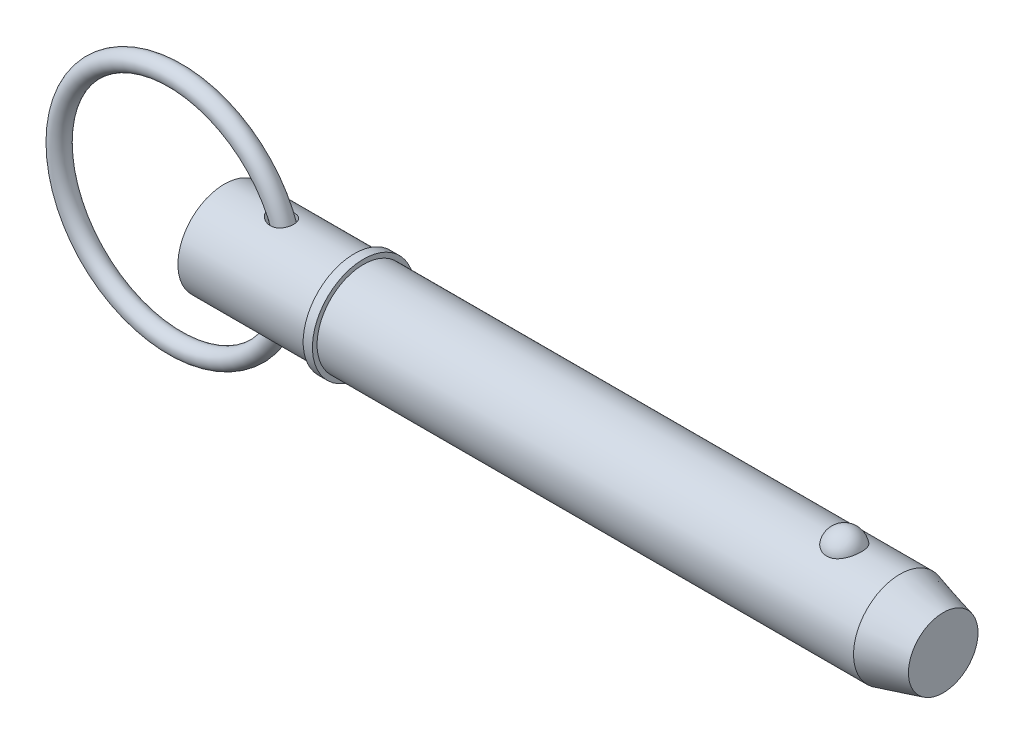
ISO-10303-21;
HEADER;
FILE_DESCRIPTION(('STEP AP214'),'2;1');
FILE_NAME('part.step','',(''),(''),'','','');
FILE_SCHEMA(('AUTOMOTIVE_DESIGN { 1 0 10303 214 1 1 1 1 }'));
ENDSEC;
DATA;
#1=APPLICATION_CONTEXT('core data for automotive mechanical design processes');
#2=APPLICATION_PROTOCOL_DEFINITION('international standard','automotive_design',2000,#1);
#3=PRODUCT_CONTEXT('',#1,'mechanical');
#4=PRODUCT('Part','Part','',(#3));
#5=PRODUCT_RELATED_PRODUCT_CATEGORY('part','',(#4));
#6=PRODUCT_DEFINITION_FORMATION('','',#4);
#7=PRODUCT_DEFINITION_CONTEXT('part definition',#1,'design');
#8=PRODUCT_DEFINITION('design','',#6,#7);
#9=PRODUCT_DEFINITION_SHAPE('','',#8);
#10=(LENGTH_UNIT() NAMED_UNIT(*) SI_UNIT(.MILLI.,.METRE.));
#11=(NAMED_UNIT(*) PLANE_ANGLE_UNIT() SI_UNIT($,.RADIAN.));
#12=(NAMED_UNIT(*) SI_UNIT($,.STERADIAN.) SOLID_ANGLE_UNIT());
#13=UNCERTAINTY_MEASURE_WITH_UNIT(LENGTH_MEASURE(1.E-05),#10,'distance_accuracy_value','');
#14=(GEOMETRIC_REPRESENTATION_CONTEXT(3) GLOBAL_UNCERTAINTY_ASSIGNED_CONTEXT((#13)) GLOBAL_UNIT_ASSIGNED_CONTEXT((#10,
#11,#12)) REPRESENTATION_CONTEXT('',''));
#15=CARTESIAN_POINT('',(0.,0.,0.));
#16=DIRECTION('',(0.,0.,1.));
#17=DIRECTION('',(1.,0.,0.));
#18=AXIS2_PLACEMENT_3D('',#15,#16,#17);
#19=CARTESIAN_POINT('',(-13.4840686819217,0.,0.));
#20=DIRECTION('',(0.,0.,1.));
#21=DIRECTION('',(1.,0.,0.));
#22=AXIS2_PLACEMENT_3D('',#19,#20,#21);
#23=TOROIDAL_SURFACE('',#22,31.75,2.54);
#24=CARTESIAN_POINT('',(20.8059313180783,0.,0.));
#25=VERTEX_POINT('',#24);
#26=VERTEX_LOOP('',#25);
#27=FACE_BOUND('',#26,.T.);
#28=ADVANCED_FACE('P0_F12',(#27),#23,.T.);
#29=CLOSED_SHELL('',(#28));
#30=MANIFOLD_SOLID_BREP('P0_B1',#29);
#31=CARTESIAN_POINT('',(0.,0.,0.));
#32=DIRECTION('',(1.,0.,0.));
#33=DIRECTION('',(0.,0.,-1.));
#34=AXIS2_PLACEMENT_3D('',#31,#32,#33);
#35=CYLINDRICAL_SURFACE('',#34,12.7);
#36=CARTESIAN_POINT('',(13.092900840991,12.5230976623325,-2.11234992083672));
#37=CARTESIAN_POINT('',(13.2535855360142,12.4976398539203,-2.26328363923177));
#38=CARTESIAN_POINT('',(13.4280602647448,12.4718592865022,-2.39955782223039));
#39=CARTESIAN_POINT('',(13.7976341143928,12.4229301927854,-2.64122157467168));
#40=CARTESIAN_POINT('',(13.9927568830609,12.3997847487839,-2.7465751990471));
#41=CARTESIAN_POINT('',(14.397672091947,12.3590534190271,-2.92439761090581));
#42=CARTESIAN_POINT('',(14.6074445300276,12.3414601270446,-2.99691026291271));
#43=CARTESIAN_POINT('',(15.0366557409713,12.3142893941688,-3.10669649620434));
#44=CARTESIAN_POINT('',(15.2560902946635,12.3047084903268,-3.14398530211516));
#45=CARTESIAN_POINT('',(15.5877843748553,12.2976819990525,-3.17128282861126));
#46=CARTESIAN_POINT('',(15.6989364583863,12.2965677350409,-3.17559470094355));
#47=CARTESIAN_POINT('',(15.9211629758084,12.2969101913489,-3.17427486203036));
#48=CARTESIAN_POINT('',(16.0322374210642,12.2983656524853,-3.16864802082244));
#49=CARTESIAN_POINT('',(16.2532861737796,12.3038832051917,-3.14715368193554));
#50=CARTESIAN_POINT('',(16.363260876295,12.3079443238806,-3.13129000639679));
#51=CARTESIAN_POINT('',(16.5810669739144,12.3185954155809,-3.08912320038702));
#52=CARTESIAN_POINT('',(16.6888986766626,12.3251850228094,-3.06282157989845));
#53=CARTESIAN_POINT('',(16.8894247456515,12.3398294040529,-3.00323791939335));
#54=CARTESIAN_POINT('',(16.9824664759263,12.3476389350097,-2.97106098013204));
#55=CARTESIAN_POINT('',(17.1651267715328,12.3648759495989,-2.89848824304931));
#56=CARTESIAN_POINT('',(17.2547457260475,12.3743032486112,-2.85809338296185));
#57=CARTESIAN_POINT('',(17.4297224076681,12.3944822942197,-2.76927391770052));
#58=CARTESIAN_POINT('',(17.5150817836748,12.40523352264,-2.72085245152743));
#59=CARTESIAN_POINT('',(17.6807665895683,12.4277046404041,-2.61629867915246));
#60=CARTESIAN_POINT('',(17.7610923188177,12.4394244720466,-2.56016683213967));
#61=CARTESIAN_POINT('',(17.9797287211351,12.4733252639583,-2.39133767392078));
#62=CARTESIAN_POINT('',(18.1114611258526,12.4961902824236,-2.27005507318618));
#63=CARTESIAN_POINT('',(18.3518677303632,12.5412050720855,-2.00648954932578));
#64=CARTESIAN_POINT('',(18.4605454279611,12.5633549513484,-1.86420981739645));
#65=CARTESIAN_POINT('',(18.6498843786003,12.6039384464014,-1.5661481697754));
#66=CARTESIAN_POINT('',(18.7311185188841,12.622444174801,-1.41073996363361));
#67=CARTESIAN_POINT('',(18.8669149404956,12.6543302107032,-1.08819514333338));
#68=CARTESIAN_POINT('',(18.921477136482,12.6677105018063,-0.921058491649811));
#69=CARTESIAN_POINT('',(19.0028875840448,12.6879542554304,-0.57902988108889));
#70=CARTESIAN_POINT('',(19.0296164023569,12.6947896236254,-0.40410783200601));
#71=CARTESIAN_POINT('',(19.0543673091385,12.7011128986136,-0.0521104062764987));
#72=CARTESIAN_POINT('',(19.0523885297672,12.7006005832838,0.124965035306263));
#73=CARTESIAN_POINT('',(19.019700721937,12.692266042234,0.476969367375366));
#74=CARTESIAN_POINT('',(18.9888798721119,12.6844153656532,0.651887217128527));
#75=CARTESIAN_POINT('',(18.8990221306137,12.6622099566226,0.99389064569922));
#76=CARTESIAN_POINT('',(18.839985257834,12.6478552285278,1.16097622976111));
#77=CARTESIAN_POINT('',(18.6951419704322,12.6142309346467,1.48231767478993));
#78=CARTESIAN_POINT('',(18.6093706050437,12.5949678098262,1.63659000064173));
#79=CARTESIAN_POINT('',(18.4131352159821,12.5536490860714,1.92810749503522));
#80=CARTESIAN_POINT('',(18.3026732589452,12.5315937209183,2.06535408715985));
#81=CARTESIAN_POINT('',(18.060669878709,12.4872833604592,2.31822774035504));
#82=CARTESIAN_POINT('',(17.9292520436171,12.4650302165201,2.43397343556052));
#83=CARTESIAN_POINT('',(17.6485957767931,12.4226514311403,2.64178289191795));
#84=CARTESIAN_POINT('',(17.4993587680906,12.4025256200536,2.73384854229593));
#85=CARTESIAN_POINT('',(17.1869531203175,12.3664726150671,2.8925825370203));
#86=CARTESIAN_POINT('',(17.0237450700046,12.3505578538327,2.95917592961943));
#87=CARTESIAN_POINT('',(16.6884731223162,12.3245177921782,3.06582547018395));
#88=CARTESIAN_POINT('',(16.516407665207,12.3143935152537,3.10587692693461));
#89=CARTESIAN_POINT('',(16.1604213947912,12.3003788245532,3.16093927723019));
#90=CARTESIAN_POINT('',(15.9763106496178,12.2967791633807,3.17478342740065));
#91=CARTESIAN_POINT('',(15.6080973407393,12.2966663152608,3.1752118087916));
#92=CARTESIAN_POINT('',(15.4239948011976,12.3001555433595,3.16178674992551));
#93=CARTESIAN_POINT('',(15.0417156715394,12.3141744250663,3.10676725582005));
#94=CARTESIAN_POINT('',(14.8439465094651,12.3253658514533,3.06251977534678));
#95=CARTESIAN_POINT('',(14.4574652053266,12.3538942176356,2.94531863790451));
#96=CARTESIAN_POINT('',(14.2687614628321,12.3712367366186,2.87233891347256));
#97=CARTESIAN_POINT('',(13.8856104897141,12.4121323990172,2.69045747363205));
#98=CARTESIAN_POINT('',(13.6926012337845,12.4361434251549,2.57861276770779));
#99=CARTESIAN_POINT('',(13.328588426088,12.4862632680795,2.32379935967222));
#100=CARTESIAN_POINT('',(13.1575718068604,12.5123708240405,2.18084927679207));
#101=CARTESIAN_POINT('',(12.8776146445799,12.5579467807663,1.89840233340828));
#102=CARTESIAN_POINT('',(12.7631663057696,12.5776642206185,1.76440341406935));
#103=CARTESIAN_POINT('',(12.5574911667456,12.6143643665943,1.47931295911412));
#104=CARTESIAN_POINT('',(12.4662309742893,12.6313509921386,1.32824646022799));
#105=CARTESIAN_POINT('',(12.3240650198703,12.6583901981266,1.03598403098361));
#106=CARTESIAN_POINT('',(12.2691183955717,12.6691064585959,0.89682285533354));
#107=CARTESIAN_POINT('',(12.1828741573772,12.6860954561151,0.611068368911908));
#108=CARTESIAN_POINT('',(12.1515620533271,12.6923709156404,0.464479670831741));
#109=CARTESIAN_POINT('',(12.1147168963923,12.6997676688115,0.167420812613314));
#110=CARTESIAN_POINT('',(12.109270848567,12.7008715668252,0.0169392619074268));
#111=CARTESIAN_POINT('',(12.1248234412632,12.6977391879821,-0.282592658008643));
#112=CARTESIAN_POINT('',(12.1458245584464,12.6935024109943,-0.431642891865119));
#113=CARTESIAN_POINT('',(12.210908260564,12.6805581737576,-0.716008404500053));
#114=CARTESIAN_POINT('',(12.2537133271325,12.6720986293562,-0.851633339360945));
#115=CARTESIAN_POINT('',(12.3591295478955,12.6516826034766,-1.11460776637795));
#116=CARTESIAN_POINT('',(12.4217455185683,12.6397252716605,-1.24195523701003));
#117=CARTESIAN_POINT('',(12.5735635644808,12.61152213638,-1.50300095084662));
#118=CARTESIAN_POINT('',(12.6652159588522,12.5949150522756,-1.63522875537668));
#119=CARTESIAN_POINT('',(12.8664347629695,12.5599626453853,-1.88501670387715));
#120=CARTESIAN_POINT('',(12.9760196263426,12.541615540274,-2.00256151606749));
#121=CARTESIAN_POINT('',(13.092900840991,12.5230976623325,-2.11234992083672));
#122=B_SPLINE_CURVE_WITH_KNOTS('',3,(#36,#37,#38,#39,#40,#41,#42,#43,#44,#45,#46,#47,#48,#49,
#50,#51,#52,#53,#54,#55,#56,#57,#58,#59,#60,#61,#62,#63,#64,#65,#66,#67,#68,#69,#70,#71,#72,#73,
#74,#75,#76,#77,#78,#79,#80,#81,#82,#83,#84,#85,#86,#87,#88,#89,#90,#91,#92,#93,#94,#95,#96,#97,
#98,#99,#100,#101,#102,#103,#104,#105,#106,#107,#108,#109,#110,#111,#112,#113,#114,#115,#116,
#117,#118,#119,#120,#121),.UNSPECIFIED.,.T.,.F.,(4,2,2,2,2,2,2,2,2,2,2,2,2,2,2,2,2,2,2,2,2,2,2,
2,2,2,2,2,2,2,2,2,2,2,2,2,2,2,2,2,2,2,4),(0.,0.665132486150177,1.33103515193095,
1.99604575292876,2.66076878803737,2.99410229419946,3.32727250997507,3.66031840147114,
3.99331613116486,4.28918991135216,4.58502994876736,4.88075456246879,5.17646157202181,
5.71510826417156,6.25367317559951,6.78017774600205,7.30668400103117,7.83544030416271,
8.36421259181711,8.89504347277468,9.42587399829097,9.95601150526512,10.4861046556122,
11.0131799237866,11.54021312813,12.0687854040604,12.597451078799,13.1491450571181,
13.7010270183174,14.3074556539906,14.914435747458,15.5844380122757,16.2540403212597,
16.7839879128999,17.3131679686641,17.7612578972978,18.2090728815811,18.658393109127,
19.1077554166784,19.5333866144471,19.959121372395,20.4424347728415,20.9262486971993),.UNSPECIFIED.);
#123=CARTESIAN_POINT('',(13.092900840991,12.5230976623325,-2.11234992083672));
#124=VERTEX_POINT('',#123);
#125=EDGE_CURVE('P1_E42',#124,#124,#122,.T.);
#126=ORIENTED_EDGE('',*,*,#125,.T.);
#127=EDGE_LOOP('',(#126));
#128=FACE_BOUND('',#127,.T.);
#129=CARTESIAN_POINT('',(0.,0.,0.));
#130=DIRECTION('',(1.,0.,0.));
#131=DIRECTION('',(0.,0.,-1.));
#132=AXIS2_PLACEMENT_3D('',#129,#130,#131);
#133=CIRCLE('',#132,12.7);
#134=CARTESIAN_POINT('',(0.,0.,-12.7));
#135=VERTEX_POINT('',#134);
#136=EDGE_CURVE('P1_E9',#135,#135,#133,.T.);
#137=ORIENTED_EDGE('',*,*,#136,.T.);
#138=EDGE_LOOP('',(#137));
#139=FACE_BOUND('',#138,.T.);
#140=CARTESIAN_POINT('',(35.56,0.,0.));
#141=DIRECTION('',(1.,0.,0.));
#142=DIRECTION('',(0.,0.,-1.));
#143=AXIS2_PLACEMENT_3D('',#140,#141,#142);
#144=CIRCLE('',#143,12.7);
#145=CARTESIAN_POINT('',(35.56,0.,-12.7));
#146=VERTEX_POINT('',#145);
#147=EDGE_CURVE('P1_E25',#146,#146,#144,.T.);
#148=ORIENTED_EDGE('',*,*,#147,.F.);
#149=EDGE_LOOP('',(#148));
#150=FACE_BOUND('',#149,.T.);
#151=CARTESIAN_POINT('',(13.092900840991,-12.5230976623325,-2.11234992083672));
#152=CARTESIAN_POINT('',(12.9659872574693,-12.5432050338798,-1.99314161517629));
#153=CARTESIAN_POINT('',(12.847667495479,-12.5631124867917,-1.86478966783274));
#154=CARTESIAN_POINT('',(12.6324721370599,-12.6007427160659,-1.59069749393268));
#155=CARTESIAN_POINT('',(12.5355833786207,-12.6184668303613,-1.444968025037));
#156=CARTESIAN_POINT('',(12.4099071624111,-12.642034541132,-1.21450950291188));
#157=CARTESIAN_POINT('',(12.3711427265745,-12.6494175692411,-1.13527163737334));
#158=CARTESIAN_POINT('',(12.3010994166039,-12.6628962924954,-0.973464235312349));
#159=CARTESIAN_POINT('',(12.2698164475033,-12.6689926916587,-0.890896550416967));
#160=CARTESIAN_POINT('',(12.2153933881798,-12.6796767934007,-0.72309085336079));
#161=CARTESIAN_POINT('',(12.192246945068,-12.6842656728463,-0.637854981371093));
#162=CARTESIAN_POINT('',(12.154603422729,-12.6917620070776,-0.465421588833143));
#163=CARTESIAN_POINT('',(12.1401047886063,-12.69466976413,-0.378224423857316));
#164=CARTESIAN_POINT('',(12.1214471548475,-12.6984180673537,-0.214417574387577));
#165=CARTESIAN_POINT('',(12.1161713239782,-12.699481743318,-0.13793855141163));
#166=CARTESIAN_POINT('',(12.1124989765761,-12.7002217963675,0.0152189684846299));
#167=CARTESIAN_POINT('',(12.1141046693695,-12.6998977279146,0.0918975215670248));
#168=CARTESIAN_POINT('',(12.1241695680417,-12.6978712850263,0.244746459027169));
#169=CARTESIAN_POINT('',(12.132625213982,-12.6961696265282,0.320917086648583));
#170=CARTESIAN_POINT('',(12.1562110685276,-12.6914452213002,0.472185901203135));
#171=CARTESIAN_POINT('',(12.1713438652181,-12.6884219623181,0.547283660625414));
#172=CARTESIAN_POINT('',(12.223731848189,-12.6780227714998,0.759415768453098));
#173=CARTESIAN_POINT('',(12.268839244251,-12.6691353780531,0.894507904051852));
#174=CARTESIAN_POINT('',(12.3786059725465,-12.6479567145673,1.1560647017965));
#175=CARTESIAN_POINT('',(12.4432700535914,-12.6356646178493,1.28252725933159));
#176=CARTESIAN_POINT('',(12.5971341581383,-12.607236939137,1.5381272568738));
#177=CARTESIAN_POINT('',(12.6882234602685,-12.5908303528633,1.66609325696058));
#178=CARTESIAN_POINT('',(12.887209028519,-12.5564642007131,1.90792082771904));
#179=CARTESIAN_POINT('',(12.995115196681,-12.5385037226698,2.02177401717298));
#180=CARTESIAN_POINT('',(13.2471335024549,-12.4987806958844,2.25547266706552));
#181=CARTESIAN_POINT('',(13.3941979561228,-12.4769622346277,2.3721269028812));
#182=CARTESIAN_POINT('',(13.7036983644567,-12.4349587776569,2.58329351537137));
#183=CARTESIAN_POINT('',(13.8661464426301,-12.4147750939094,2.67778822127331));
#184=CARTESIAN_POINT('',(14.2306024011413,-12.3748157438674,2.85722657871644));
#185=CARTESIAN_POINT('',(14.4347220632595,-12.3556533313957,2.93804226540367));
#186=CARTESIAN_POINT('',(14.8540416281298,-12.3245430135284,3.06594877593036));
#187=CARTESIAN_POINT('',(15.0692453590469,-12.3125976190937,3.11302786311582));
#188=CARTESIAN_POINT('',(15.3981213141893,-12.3014943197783,3.15648626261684));
#189=CARTESIAN_POINT('',(15.5100235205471,-12.298940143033,3.16639841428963));
#190=CARTESIAN_POINT('',(15.7342812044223,-12.2963942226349,3.17627668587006));
#191=CARTESIAN_POINT('',(15.8466364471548,-12.2964012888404,3.17624742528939));
#192=CARTESIAN_POINT('',(16.0707903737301,-12.2990694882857,3.16589868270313));
#193=CARTESIAN_POINT('',(16.1825892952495,-12.3017293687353,3.1555840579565));
#194=CARTESIAN_POINT('',(16.4046123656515,-12.3096862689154,3.12440163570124));
#195=CARTESIAN_POINT('',(16.514836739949,-12.314982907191,3.10353536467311));
#196=CARTESIAN_POINT('',(16.7211934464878,-12.3273933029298,3.05384263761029));
#197=CARTESIAN_POINT('',(16.8175961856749,-12.3342598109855,3.0260738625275));
#198=CARTESIAN_POINT('',(17.0073515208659,-12.3498131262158,2.96195947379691));
#199=CARTESIAN_POINT('',(17.100704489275,-12.3584997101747,2.92561491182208));
#200=CARTESIAN_POINT('',(17.2834584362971,-12.3774243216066,2.84448580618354));
#201=CARTESIAN_POINT('',(17.3728610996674,-12.3876616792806,2.79970490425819));
#202=CARTESIAN_POINT('',(17.5469061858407,-12.409352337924,2.701939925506));
#203=CARTESIAN_POINT('',(17.6315489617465,-12.4208055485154,2.64895645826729));
#204=CARTESIAN_POINT('',(17.7872886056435,-12.4433734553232,2.54070972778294));
#205=CARTESIAN_POINT('',(17.8589017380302,-12.4544123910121,2.4861716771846));
#206=CARTESIAN_POINT('',(17.9970802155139,-12.4768404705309,2.37105291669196));
#207=CARTESIAN_POINT('',(18.063643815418,-12.4882297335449,2.31047013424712));
#208=CARTESIAN_POINT('',(18.1911677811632,-12.5110137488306,2.18372894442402));
#209=CARTESIAN_POINT('',(18.2521311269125,-12.5224084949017,2.11757353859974));
#210=CARTESIAN_POINT('',(18.3680676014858,-12.5448751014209,1.98014449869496));
#211=CARTESIAN_POINT('',(18.4230385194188,-12.5559468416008,1.90886899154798));
#212=CARTESIAN_POINT('',(18.5752306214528,-12.5875288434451,1.6925769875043));
#213=CARTESIAN_POINT('',(18.6637018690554,-12.6071482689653,1.54111740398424));
#214=CARTESIAN_POINT('',(18.8143485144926,-12.6417556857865,1.225260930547));
#215=CARTESIAN_POINT('',(18.876524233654,-12.6567437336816,1.06086419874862));
#216=CARTESIAN_POINT('',(18.9733884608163,-12.6805238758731,0.723195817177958));
#217=CARTESIAN_POINT('',(19.0079967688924,-12.6892978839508,0.549899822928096));
#218=CARTESIAN_POINT('',(19.0486500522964,-12.6996362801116,0.199781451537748));
#219=CARTESIAN_POINT('',(19.054694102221,-12.7012004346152,0.0229589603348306));
#220=CARTESIAN_POINT('',(19.0380549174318,-12.6969431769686,-0.330044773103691));
#221=CARTESIAN_POINT('',(19.0152419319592,-12.6910884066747,-0.506219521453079));
#222=CARTESIAN_POINT('',(18.9411599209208,-12.672565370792,-0.852112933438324));
#223=CARTESIAN_POINT('',(18.8898907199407,-12.659897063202,-1.0218315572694));
#224=CARTESIAN_POINT('',(18.7600888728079,-12.6291327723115,-1.34987035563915));
#225=CARTESIAN_POINT('',(18.6815715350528,-12.6110398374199,-1.50819687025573));
#226=CARTESIAN_POINT('',(18.4991526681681,-12.5714188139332,-1.808997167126));
#227=CARTESIAN_POINT('',(18.3952529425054,-12.5498909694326,-1.95147207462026));
#228=CARTESIAN_POINT('',(18.1653806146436,-12.5059234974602,-2.21580059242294));
#229=CARTESIAN_POINT('',(18.0395297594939,-12.4834893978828,-2.33776101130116));
#230=CARTESIAN_POINT('',(17.7688701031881,-12.4400863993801,-2.55870399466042));
#231=CARTESIAN_POINT('',(17.624063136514,-12.4191173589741,-2.65768878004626));
#232=CARTESIAN_POINT('',(17.3196803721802,-12.380896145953,-2.8304192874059));
#233=CARTESIAN_POINT('',(17.1601036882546,-12.3636441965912,-2.90416349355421));
#234=CARTESIAN_POINT('',(16.8308162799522,-12.3345597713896,-3.02531546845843));
#235=CARTESIAN_POINT('',(16.6611041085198,-12.322728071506,-3.07271946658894));
#236=CARTESIAN_POINT('',(16.3099674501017,-12.3051318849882,-3.14246490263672));
#237=CARTESIAN_POINT('',(16.1283412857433,-12.2996014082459,-3.16384159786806));
#238=CARTESIAN_POINT('',(15.7639014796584,-12.2955807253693,-3.17942379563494));
#239=CARTESIAN_POINT('',(15.5810875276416,-12.2970924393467,-3.17362188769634));
#240=CARTESIAN_POINT('',(15.20154276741,-12.307074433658,-3.13470416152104));
#241=CARTESIAN_POINT('',(15.0050835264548,-12.316173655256,-3.09911848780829));
#242=CARTESIAN_POINT('',(14.6197996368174,-12.3407987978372,-2.99954607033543));
#243=CARTESIAN_POINT('',(14.4309834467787,-12.3563316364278,-2.93552875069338));
#244=CARTESIAN_POINT('',(14.0353751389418,-12.3949378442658,-2.76840280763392));
#245=CARTESIAN_POINT('',(13.8306109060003,-12.4188242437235,-2.66064798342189));
#246=CARTESIAN_POINT('',(13.4432099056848,-12.4696241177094,-2.4113475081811));
#247=CARTESIAN_POINT('',(13.2605568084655,-12.4965353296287,-2.26982702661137));
#248=CARTESIAN_POINT('',(13.092900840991,-12.5230976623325,-2.11234992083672));
#249=B_SPLINE_CURVE_WITH_KNOTS('',3,(#151,#152,#153,#154,#155,#156,#157,#158,#159,#160,#161,
#162,#163,#164,#165,#166,#167,#168,#169,#170,#171,#172,#173,#174,#175,#176,#177,#178,#179,#180,
#181,#182,#183,#184,#185,#186,#187,#188,#189,#190,#191,#192,#193,#194,#195,#196,#197,#198,#199,
#200,#201,#202,#203,#204,#205,#206,#207,#208,#209,#210,#211,#212,#213,#214,#215,#216,#217,#218,
#219,#220,#221,#222,#223,#224,#225,#226,#227,#228,#229,#230,#231,#232,#233,#234,#235,#236,#237,
#238,#239,#240,#241,#242,#243,#244,#245,#246,#247,#248),.UNSPECIFIED.,.T.,.F.,(4,2,2,2,2,2,2,2,
2,2,2,2,2,2,2,2,2,2,2,2,2,2,2,2,2,2,2,2,2,2,2,2,2,2,2,2,2,2,2,2,2,2,2,2,2,2,2,2,4),(0.,
0.525289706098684,1.05025590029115,1.31549608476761,1.58059075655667,1.84547798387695,
2.11031756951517,2.34000998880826,2.56977615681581,2.79942299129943,3.0291589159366,
3.45531787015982,3.8815803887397,4.35362362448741,4.82594586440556,5.39074449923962,
5.95599200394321,6.61421946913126,7.27267581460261,7.60939383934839,7.94595540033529,
8.2823580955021,8.61871213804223,8.91997243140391,9.22119579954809,9.52228943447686,
9.82336070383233,10.0950952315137,10.3669232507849,10.6386057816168,10.9103882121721,
11.4371688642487,11.9639430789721,12.4922442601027,13.0205625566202,13.5512648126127,
14.0819703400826,14.6123781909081,15.1427483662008,15.6702654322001,16.1977314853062,
16.7252292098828,17.2528024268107,17.7993878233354,18.3461222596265,18.9432829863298,
19.5410874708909,20.2355241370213,20.9294447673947),.UNSPECIFIED.);
#250=CARTESIAN_POINT('',(13.092900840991,-12.5230976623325,-2.11234992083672));
#251=VERTEX_POINT('',#250);
#252=EDGE_CURVE('P1_E17',#251,#251,#249,.T.);
#253=ORIENTED_EDGE('',*,*,#252,.T.);
#254=EDGE_LOOP('',(#253));
#255=FACE_BOUND('',#254,.T.);
#256=ADVANCED_FACE('P1_F13',(#128,#139,#150,#255),#35,.T.);
#257=CARTESIAN_POINT('',(0.,0.,0.));
#258=DIRECTION('',(1.,0.,0.));
#259=DIRECTION('',(0.,0.,-1.));
#260=AXIS2_PLACEMENT_3D('',#257,#258,#259);
#261=CYLINDRICAL_SURFACE('',#260,12.7);
#262=CARTESIAN_POINT('',(185.000738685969,0.,0.));
#263=DIRECTION('',(1.,0.,0.));
#264=DIRECTION('',(0.,0.,-1.));
#265=AXIS2_PLACEMENT_3D('',#262,#263,#264);
#266=CIRCLE('',#265,12.7);
#267=CARTESIAN_POINT('',(185.000738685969,0.,-12.7));
#268=VERTEX_POINT('',#267);
#269=EDGE_CURVE('P1_E99',#268,#268,#266,.T.);
#270=ORIENTED_EDGE('',*,*,#269,.F.);
#271=EDGE_LOOP('',(#270));
#272=FACE_BOUND('',#271,.T.);
#273=CARTESIAN_POINT('',(38.1,0.,0.));
#274=DIRECTION('',(1.,0.,0.));
#275=DIRECTION('',(0.,0.,-1.));
#276=AXIS2_PLACEMENT_3D('',#273,#274,#275);
#277=CIRCLE('',#276,12.7);
#278=CARTESIAN_POINT('',(38.1,0.,-12.7));
#279=VERTEX_POINT('',#278);
#280=EDGE_CURVE('P1_E96',#279,#279,#277,.T.);
#281=ORIENTED_EDGE('',*,*,#280,.T.);
#282=EDGE_LOOP('',(#281));
#283=FACE_BOUND('',#282,.T.);
#284=CARTESIAN_POINT('',(169.760042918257,11.7500437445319,4.81938502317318));
#285=CARTESIAN_POINT('',(169.635088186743,11.7500430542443,4.81938571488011));
#286=CARTESIAN_POINT('',(169.510144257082,11.7520975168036,4.81438658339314));
#287=CARTESIAN_POINT('',(169.261142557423,11.760253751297,4.79442904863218));
#288=CARTESIAN_POINT('',(169.137085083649,11.7663568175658,4.77946746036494));
#289=CARTESIAN_POINT('',(168.890901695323,11.7824262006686,4.7397141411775));
#290=CARTESIAN_POINT('',(168.768774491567,11.7923898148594,4.71492928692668));
#291=CARTESIAN_POINT('',(168.527187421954,11.8158938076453,4.65571340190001));
#292=CARTESIAN_POINT('',(168.40772859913,11.8294355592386,4.6212786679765));
#293=CARTESIAN_POINT('',(168.172557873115,11.8596812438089,4.54309502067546));
#294=CARTESIAN_POINT('',(168.056839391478,11.8763792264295,4.49936361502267));
#295=CARTESIAN_POINT('',(167.829653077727,11.9124878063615,4.40287235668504));
#296=CARTESIAN_POINT('',(167.718186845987,11.9318994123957,4.35010914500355));
#297=CARTESIAN_POINT('',(167.391278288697,11.9934256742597,4.17881316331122));
#298=CARTESIAN_POINT('',(167.183127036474,12.038858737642,4.04720756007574));
#299=CARTESIAN_POINT('',(166.785850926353,12.1352173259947,3.748564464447));
#300=CARTESIAN_POINT('',(166.597443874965,12.1862630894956,3.58061821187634));
#301=CARTESIAN_POINT('',(166.250521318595,12.2875163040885,3.21600758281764));
#302=CARTESIAN_POINT('',(166.092011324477,12.3377235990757,3.01933792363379));
#303=CARTESIAN_POINT('',(165.80168878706,12.4344923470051,2.592916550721));
#304=CARTESIAN_POINT('',(165.671376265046,12.4807925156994,2.36208286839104));
#305=CARTESIAN_POINT('',(165.449407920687,12.5623454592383,1.88070399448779));
#306=CARTESIAN_POINT('',(165.357755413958,12.5975972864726,1.63015711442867));
#307=CARTESIAN_POINT('',(165.214046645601,12.6538414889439,1.1129886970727));
#308=CARTESIAN_POINT('',(165.162499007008,12.6746503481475,0.846205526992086));
#309=CARTESIAN_POINT('',(165.101977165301,12.699153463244,0.307085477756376));
#310=CARTESIAN_POINT('',(165.093001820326,12.7028481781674,0.0347487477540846));
#311=CARTESIAN_POINT('',(165.117731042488,12.6927785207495,-0.506073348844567));
#312=CARTESIAN_POINT('',(165.151189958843,12.6791146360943,-0.774571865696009));
#313=CARTESIAN_POINT('',(165.259687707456,12.635882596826,-1.30170246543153));
#314=CARTESIAN_POINT('',(165.33472729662,12.606314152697,-1.56033436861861));
#315=CARTESIAN_POINT('',(165.52500006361,12.5342328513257,-2.0608389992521));
#316=CARTESIAN_POINT('',(165.640287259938,12.4917026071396,-2.30268867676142));
#317=CARTESIAN_POINT('',(165.908704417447,12.3981123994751,-2.76259600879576));
#318=CARTESIAN_POINT('',(166.061837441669,12.3470517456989,-2.98065173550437));
#319=CARTESIAN_POINT('',(166.403507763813,12.2416045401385,-3.38786328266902));
#320=CARTESIAN_POINT('',(166.592201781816,12.1872040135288,-3.57688418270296));
#321=CARTESIAN_POINT('',(167.000239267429,12.0814086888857,-3.91941073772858));
#322=CARTESIAN_POINT('',(167.219580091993,12.0300136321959,-4.07291945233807));
#323=CARTESIAN_POINT('',(167.678375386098,11.9373542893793,-4.33691289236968));
#324=CARTESIAN_POINT('',(167.917304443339,11.8958982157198,-4.44824125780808));
#325=CARTESIAN_POINT('',(168.41243761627,11.8268116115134,-4.62881985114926));
#326=CARTESIAN_POINT('',(168.668635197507,11.7991758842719,-4.69808589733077));
#327=CARTESIAN_POINT('',(169.177164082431,11.7622209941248,-4.78983181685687));
#328=CARTESIAN_POINT('',(169.429041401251,11.7520502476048,-4.81449025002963));
#329=CARTESIAN_POINT('',(169.933573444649,11.7485796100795,-4.82295735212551));
#330=CARTESIAN_POINT('',(170.186228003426,11.7552763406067,-4.80677420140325));
#331=CARTESIAN_POINT('',(170.676834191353,11.7842584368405,-4.73525430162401));
#332=CARTESIAN_POINT('',(170.914998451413,11.8060486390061,-4.68116061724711));
#333=CARTESIAN_POINT('',(171.378489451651,11.8622750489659,-4.53678133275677));
#334=CARTESIAN_POINT('',(171.603815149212,11.8967122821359,-4.44649279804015));
#335=CARTESIAN_POINT('',(172.040801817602,11.9754603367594,-4.2298761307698));
#336=CARTESIAN_POINT('',(172.252057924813,12.0199699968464,-4.10280539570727));
#337=CARTESIAN_POINT('',(172.650601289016,12.1138028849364,-3.81685409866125));
#338=CARTESIAN_POINT('',(172.837883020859,12.163127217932,-3.65796622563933));
#339=CARTESIAN_POINT('',(173.193350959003,12.2642343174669,-3.30364864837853));
#340=CARTESIAN_POINT('',(173.360111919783,12.3160165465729,-3.10678783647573));
#341=CARTESIAN_POINT('',(173.659579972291,12.4142566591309,-2.68748409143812));
#342=CARTESIAN_POINT('',(173.792280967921,12.4607135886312,-2.4650365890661));
#343=CARTESIAN_POINT('',(174.024691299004,12.5450236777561,-1.9928951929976));
#344=CARTESIAN_POINT('',(174.123215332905,12.5825557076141,-1.74255918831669));
#345=CARTESIAN_POINT('',(174.279227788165,12.6431720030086,-1.2277373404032));
#346=CARTESIAN_POINT('',(174.336715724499,12.6662560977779,-0.96325132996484));
#347=CARTESIAN_POINT('',(174.409544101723,12.6956486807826,-0.427355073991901));
#348=CARTESIAN_POINT('',(174.424837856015,12.7019385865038,-0.155937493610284));
#349=CARTESIAN_POINT('',(174.412779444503,12.6970201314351,0.385928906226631));
#350=CARTESIAN_POINT('',(174.38542805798,12.6858120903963,0.65637774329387));
#351=CARTESIAN_POINT('',(174.313060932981,12.6568455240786,1.05454017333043));
#352=CARTESIAN_POINT('',(174.283796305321,12.6451962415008,1.185778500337));
#353=CARTESIAN_POINT('',(174.215022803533,12.6181819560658,1.44513808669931));
#354=CARTESIAN_POINT('',(174.175517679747,12.6028183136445,1.57326046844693));
#355=CARTESIAN_POINT('',(174.086439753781,12.5687547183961,1.82554978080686));
#356=CARTESIAN_POINT('',(174.036862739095,12.5500533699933,1.9497150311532));
#357=CARTESIAN_POINT('',(173.92792115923,12.5098093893,2.1931437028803));
#358=CARTESIAN_POINT('',(173.868560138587,12.4882677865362,2.31240887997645));
#359=CARTESIAN_POINT('',(173.73997128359,12.4427679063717,2.5459303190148));
#360=CARTESIAN_POINT('',(173.670688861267,12.4187964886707,2.66015396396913));
#361=CARTESIAN_POINT('',(173.522903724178,12.3691892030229,2.88202659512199));
#362=CARTESIAN_POINT('',(173.444404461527,12.3435539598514,2.98967802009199));
#363=CARTESIAN_POINT('',(173.27855022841,12.2912955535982,3.1977438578));
#364=CARTESIAN_POINT('',(173.191191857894,12.2646720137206,3.29815546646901));
#365=CARTESIAN_POINT('',(173.008161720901,12.2111945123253,3.49095035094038));
#366=CARTESIAN_POINT('',(172.912493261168,12.1843406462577,3.58333679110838));
#367=CARTESIAN_POINT('',(172.713627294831,12.1312249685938,3.75922876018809));
#368=CARTESIAN_POINT('',(172.610450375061,12.104961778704,3.84275713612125));
#369=CARTESIAN_POINT('',(172.39701336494,12.0537284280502,4.00056406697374));
#370=CARTESIAN_POINT('',(172.286756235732,12.028757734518,4.07484645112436));
#371=CARTESIAN_POINT('',(172.059755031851,11.9808306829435,4.21367959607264));
#372=CARTESIAN_POINT('',(171.943006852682,11.9578756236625,4.27822410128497));
#373=CARTESIAN_POINT('',(171.70394258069,11.9147184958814,4.39698483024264));
#374=CARTESIAN_POINT('',(171.581628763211,11.894515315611,4.45120522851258));
#375=CARTESIAN_POINT('',(171.322952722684,11.8561129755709,4.55255353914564));
#376=CARTESIAN_POINT('',(171.186223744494,11.8381764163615,4.59884858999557));
#377=CARTESIAN_POINT('',(170.908608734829,11.8069093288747,4.67853897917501));
#378=CARTESIAN_POINT('',(170.767724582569,11.7935767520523,4.71194005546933));
#379=CARTESIAN_POINT('',(170.48309446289,11.7720277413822,4.76552188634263));
#380=CARTESIAN_POINT('',(170.339348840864,11.7638106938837,4.78570422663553));
#381=CARTESIAN_POINT('',(170.050411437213,11.7528195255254,4.81263433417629));
#382=CARTESIAN_POINT('',(169.905219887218,11.7500445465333,4.81938421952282));
#383=CARTESIAN_POINT('',(169.760042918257,11.7500437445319,4.81938502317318));
#384=B_SPLINE_CURVE_WITH_KNOTS('',3,(#284,#285,#286,#287,#288,#289,#290,#291,#292,#293,#294,
#295,#296,#297,#298,#299,#300,#301,#302,#303,#304,#305,#306,#307,#308,#309,#310,#311,#312,#313,
#314,#315,#316,#317,#318,#319,#320,#321,#322,#323,#324,#325,#326,#327,#328,#329,#330,#331,#332,
#333,#334,#335,#336,#337,#338,#339,#340,#341,#342,#343,#344,#345,#346,#347,#348,#349,#350,#351,
#352,#353,#354,#355,#356,#357,#358,#359,#360,#361,#362,#363,#364,#365,#366,#367,#368,#369,#370,
#371,#372,#373,#374,#375,#376,#377,#378,#379,#380,#381,#382,#383),.UNSPECIFIED.,.T.,.F.,(4,2,2,
2,2,2,2,2,2,2,2,2,2,2,2,2,2,2,2,2,2,2,2,2,2,2,2,2,2,2,2,2,2,2,2,2,2,2,2,2,2,2,2,2,2,2,2,2,2,4),
(0.,0.374729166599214,0.749578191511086,1.12416526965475,1.49889629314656,1.87292776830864,
2.24709865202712,2.99481328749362,3.76399449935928,4.53331735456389,5.3368391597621,
6.14042986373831,6.95405296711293,7.76765424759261,8.57656703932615,9.38549455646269,
10.1955119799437,11.0055949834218,11.8193353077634,12.6330054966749,13.4294141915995,
14.2255231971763,14.9815786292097,15.7374826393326,16.4696948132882,17.2019663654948,
17.9501979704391,18.6986017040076,19.484470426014,20.2704797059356,21.0815215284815,
21.8925729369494,22.7045213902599,23.5164550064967,23.9209608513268,24.3253187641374,
24.7298461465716,25.1342272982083,25.54092555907,25.9474719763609,26.3541750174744,
26.7607169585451,27.1661834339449,27.5714814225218,27.9770386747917,28.3824315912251,
28.818120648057,29.2536155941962,29.6890582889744,30.1244323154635),.UNSPECIFIED.);
#385=CARTESIAN_POINT('',(169.760042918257,11.7500437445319,4.81938502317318));
#386=VERTEX_POINT('',#385);
#387=EDGE_CURVE('P1_E34',#386,#386,#384,.T.);
#388=ORIENTED_EDGE('',*,*,#387,.T.);
#389=EDGE_LOOP('',(#388));
#390=FACE_BOUND('',#389,.T.);
#391=ADVANCED_FACE('P1_F46',(#272,#283,#390),#261,.T.);
#392=CARTESIAN_POINT('',(0.,0.,0.));
#393=DIRECTION('',(-1.,0.,0.));
#394=DIRECTION('',(0.,0.,1.));
#395=AXIS2_PLACEMENT_3D('',#392,#393,#394);
#396=PLANE('',#395);
#397=ORIENTED_EDGE('',*,*,#136,.F.);
#398=EDGE_LOOP('',(#397));
#399=FACE_BOUND('',#398,.T.);
#400=ADVANCED_FACE('P1_F15',(#399),#396,.T.);
#401=CARTESIAN_POINT('',(35.56,12.7,0.));
#402=DIRECTION('',(-1.,0.,0.));
#403=DIRECTION('',(0.,0.,1.));
#404=AXIS2_PLACEMENT_3D('',#401,#402,#403);
#405=PLANE('',#404);
#406=ORIENTED_EDGE('',*,*,#147,.T.);
#407=EDGE_LOOP('',(#406));
#408=FACE_BOUND('',#407,.T.);
#409=CARTESIAN_POINT('',(35.56,0.,0.));
#410=DIRECTION('',(1.,0.,0.));
#411=DIRECTION('',(0.,0.,-1.));
#412=AXIS2_PLACEMENT_3D('',#409,#410,#411);
#413=CIRCLE('',#412,13.97);
#414=CARTESIAN_POINT('',(35.56,0.,-13.97));
#415=VERTEX_POINT('',#414);
#416=EDGE_CURVE('P1_E30',#415,#415,#413,.T.);
#417=ORIENTED_EDGE('',*,*,#416,.F.);
#418=EDGE_LOOP('',(#417));
#419=FACE_BOUND('',#418,.T.);
#420=ADVANCED_FACE('P1_F81',(#408,#419),#405,.T.);
#421=CARTESIAN_POINT('',(0.,0.,0.));
#422=DIRECTION('',(1.,0.,0.));
#423=DIRECTION('',(0.,0.,-1.));
#424=AXIS2_PLACEMENT_3D('',#421,#422,#423);
#425=CYLINDRICAL_SURFACE('',#424,13.97);
#426=ORIENTED_EDGE('',*,*,#416,.T.);
#427=EDGE_LOOP('',(#426));
#428=FACE_BOUND('',#427,.T.);
#429=CARTESIAN_POINT('',(38.1,0.,0.));
#430=DIRECTION('',(1.,0.,0.));
#431=DIRECTION('',(0.,0.,-1.));
#432=AXIS2_PLACEMENT_3D('',#429,#430,#431);
#433=CIRCLE('',#432,13.97);
#434=CARTESIAN_POINT('',(38.1,0.,-13.97));
#435=VERTEX_POINT('',#434);
#436=EDGE_CURVE('P1_E95',#435,#435,#433,.T.);
#437=ORIENTED_EDGE('',*,*,#436,.F.);
#438=EDGE_LOOP('',(#437));
#439=FACE_BOUND('',#438,.T.);
#440=ADVANCED_FACE('P1_F68',(#428,#439),#425,.T.);
#441=CARTESIAN_POINT('',(38.1,13.97,0.));
#442=DIRECTION('',(1.,0.,0.));
#443=DIRECTION('',(0.,0.,-1.));
#444=AXIS2_PLACEMENT_3D('',#441,#442,#443);
#445=PLANE('',#444);
#446=ORIENTED_EDGE('',*,*,#436,.T.);
#447=EDGE_LOOP('',(#446));
#448=FACE_BOUND('',#447,.T.);
#449=ORIENTED_EDGE('',*,*,#280,.F.);
#450=EDGE_LOOP('',(#449));
#451=FACE_BOUND('',#450,.T.);
#452=ADVANCED_FACE('P1_F62',(#448,#451),#445,.T.);
#453=CARTESIAN_POINT('',(196.85,0.,0.));
#454=DIRECTION('',(-1.,0.,0.));
#455=DIRECTION('',(0.,0.,1.));
#456=AXIS2_PLACEMENT_3D('',#453,#454,#455);
#457=CONICAL_SURFACE('',#456,9.52500000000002,0.261799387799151);
#458=ORIENTED_EDGE('',*,*,#269,.T.);
#459=EDGE_LOOP('',(#458));
#460=FACE_BOUND('',#459,.T.);
#461=CARTESIAN_POINT('',(196.85,0.,0.));
#462=DIRECTION('',(1.,0.,0.));
#463=DIRECTION('',(0.,0.,-1.));
#464=AXIS2_PLACEMENT_3D('',#461,#462,#463);
#465=CIRCLE('',#464,9.52500000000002);
#466=CARTESIAN_POINT('',(196.85,0.,-9.52500000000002));
#467=VERTEX_POINT('',#466);
#468=EDGE_CURVE('P1_E41',#467,#467,#465,.T.);
#469=ORIENTED_EDGE('',*,*,#468,.F.);
#470=EDGE_LOOP('',(#469));
#471=FACE_BOUND('',#470,.T.);
#472=ADVANCED_FACE('P1_F59',(#460,#471),#457,.T.);
#473=CARTESIAN_POINT('',(196.85,9.52500000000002,0.));
#474=DIRECTION('',(1.,0.,0.));
#475=DIRECTION('',(0.,0.,-1.));
#476=AXIS2_PLACEMENT_3D('',#473,#474,#475);
#477=PLANE('',#476);
#478=ORIENTED_EDGE('',*,*,#468,.T.);
#479=EDGE_LOOP('',(#478));
#480=FACE_BOUND('',#479,.T.);
#481=ADVANCED_FACE('P1_F55',(#480),#477,.T.);
#482=CARTESIAN_POINT('',(169.760042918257,11.43,0.));
#483=DIRECTION('',(-1.,0.,0.));
#484=DIRECTION('',(0.,1.,0.));
#485=AXIS2_PLACEMENT_3D('',#482,#483,#484);
#486=SPHERICAL_SURFACE('',#485,4.83);
#487=ORIENTED_EDGE('',*,*,#387,.F.);
#488=EDGE_LOOP('',(#487));
#489=FACE_BOUND('',#488,.T.);
#490=ADVANCED_FACE('P1_F50',(#489),#486,.T.);
#491=CARTESIAN_POINT('',(-13.4840686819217,0.,0.));
#492=DIRECTION('',(0.,0.,1.));
#493=DIRECTION('',(1.,0.,0.));
#494=AXIS2_PLACEMENT_3D('',#491,#492,#493);
#495=TOROIDAL_SURFACE('',#494,31.75,3.175);
#496=ORIENTED_EDGE('',*,*,#252,.F.);
#497=EDGE_LOOP('',(#496));
#498=FACE_BOUND('',#497,.T.);
#499=ORIENTED_EDGE('',*,*,#125,.F.);
#500=EDGE_LOOP('',(#499));
#501=FACE_BOUND('',#500,.T.);
#502=ADVANCED_FACE('P1_F54',(#498,#501),#495,.F.);
#503=CLOSED_SHELL('',(#256,#391,#400,#420,#440,#452,#472,#481,#490,#502));
#504=MANIFOLD_SOLID_BREP('P1_B1',#503);
#505=ADVANCED_BREP_SHAPE_REPRESENTATION('',(#18,#30,#504),#14);
#506=SHAPE_DEFINITION_REPRESENTATION(#9,#505);
ENDSEC;
END-ISO-10303-21;
